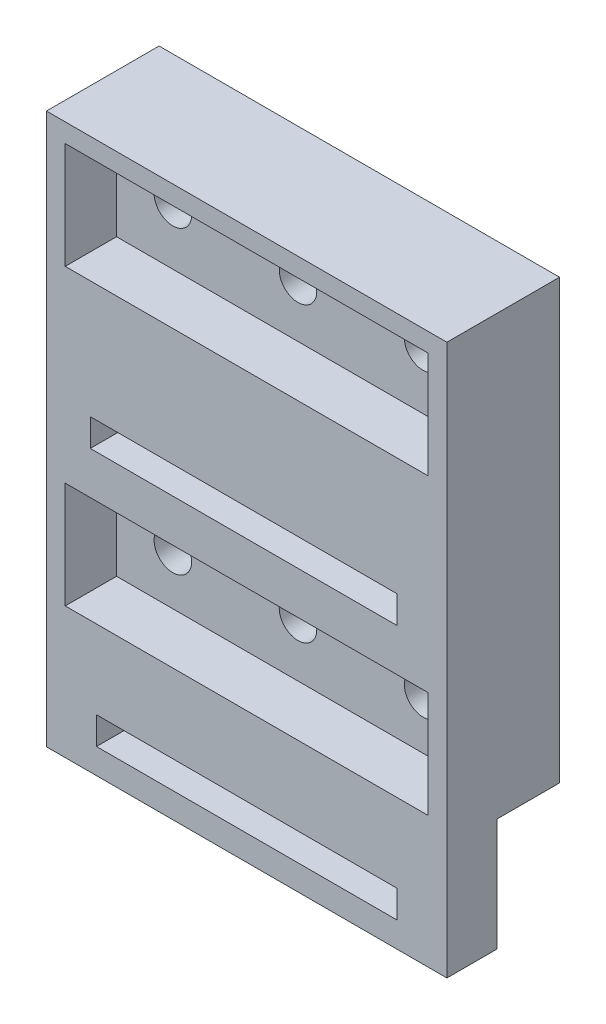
from build123d import *

# Parameters (mm, degrees)
SKETCH4_W                 = 32
SKETCH4_H                 = 35
BOSS_EXTRUDE1_DEPTH       = 9
SHELL1_T                  = -1.5
SHELL1_THICKNESS_2_FACE_W = 29
SHELL1_THICKNESS_2_FACE_H = 32
SHELL1_THICKNESS_2_DEPTH  = 3.4
SKETCH5_R                 = 1.5
CUT_EXTRUDE2_DEPTH        = 9
RIB6_REACH                = 27.362
SKETCH12_WALLS_W          = 81.724747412
SKETCH12_WALLS_H          = 15
SKETCH13_W                = 28
SKETCH13_H                = 8
CUT_EXTRUDE3_DEPTH        = 5
SKETCH15_W                = 24.5
SKETCH15_H                = 2.2
CUT_EXTRUDE4_DEPTH        = 10
SKETCH16_W                = 32
SKETCH16_H                = 4
BOSS_EXTRUDE2_DEPTH       = 9
SKETCH17_W                = 24
SKETCH17_H                = 2.2
CUT_EXTRUDE5_DEPTH        = 10


with BuildPart() as part:
    # Sketch4 → Boss-Extrude1 (new body)
    with BuildSketch(Plane.XY):
        Rectangle(SKETCH4_W, SKETCH4_H)
    extrude(amount=BOSS_EXTRUDE1_DEPTH)

    # Shell1
    shell1_openings = [part.faces().sort_by_distance(p)[0] for p in [
        (0, 0, 9),
    ]]
    offset(amount=SHELL1_T, openings=shell1_openings, kind=Kind.INTERSECTION)

    # Shell1 thickness 2 face (on inner face of the shell) → Shell1 thickness 2 (add)
    with BuildSketch(Plane(origin=(0, 0, 1.5), x_dir=(-1, 0, 0), z_dir=(0, 0, -1))):
        Rectangle(SHELL1_THICKNESS_2_FACE_W, SHELL1_THICKNESS_2_FACE_H)
    extrude(amount=-SHELL1_THICKNESS_2_DEPTH)

    # Sketch5 → Cut-Extrude2 (cut)
    with BuildSketch(Plane.XY.offset(4.9)):
        with Locations((-10, -12)):
            Circle(SKETCH5_R)
        with Locations((10, -12)):
            Circle(SKETCH5_R)
        with Locations((0, 11.7)):
            Circle(SKETCH5_R)
        with Locations((0, -11.7)):
            Circle(SKETCH5_R)
        with Locations((-10, 12)):
            Circle(SKETCH5_R)
        with Locations((10, 12)):
            Circle(SKETCH5_R)
    extrude(amount=-CUT_EXTRUDE2_DEPTH, mode=Mode.SUBTRACT)

    # Sketch12 walls → Rib6 (add, up to next)
    with BuildSketch(Plane.XY.offset(9), mode=Mode.PRIVATE) as rib6_sk1:
        Rectangle(SKETCH12_WALLS_W, SKETCH12_WALLS_H)
    rib6_tool1 = extrude(rib6_sk1.sketch, amount=-RIB6_REACH, mode=Mode.PRIVATE) - part.part
    add(rib6_tool1.solids().sort_by_distance((0, 0, 9))[0])

    # Sketch13 → Cut-Extrude3 (cut)
    with BuildSketch(Plane(origin=(0, 0, 0), x_dir=(-1, 0, 0), z_dir=(0, 0, -1))):
        with Locations((0, -3)):
            Rectangle(SKETCH13_W, SKETCH13_H)
    extrude(amount=-CUT_EXTRUDE3_DEPTH, mode=Mode.SUBTRACT)

    # Sketch15 → Cut-Extrude4 (cut)
    with BuildSketch(Plane(origin=(0, 0, 5), x_dir=(-1, 0, 0), z_dir=(0, 0, -1))):
        with Locations((0.25, -3)):
            Rectangle(SKETCH15_W, SKETCH15_H)
    extrude(amount=-CUT_EXTRUDE4_DEPTH, mode=Mode.SUBTRACT)

    # Sketch16 → Boss-Extrude2 (add)
    with BuildSketch(Plane.XZ.offset(17.5)):
        with Locations((0, 7)):
            Rectangle(SKETCH16_W, SKETCH16_H)
    extrude(amount=BOSS_EXTRUDE2_DEPTH)

    # Sketch17 → Cut-Extrude5 (cut)
    with BuildSketch(Plane.XY.offset(9)):
        with Locations((0, -23.38)):
            Rectangle(SKETCH17_W, SKETCH17_H)
    extrude(amount=-CUT_EXTRUDE5_DEPTH, mode=Mode.SUBTRACT)


solid = part.part
